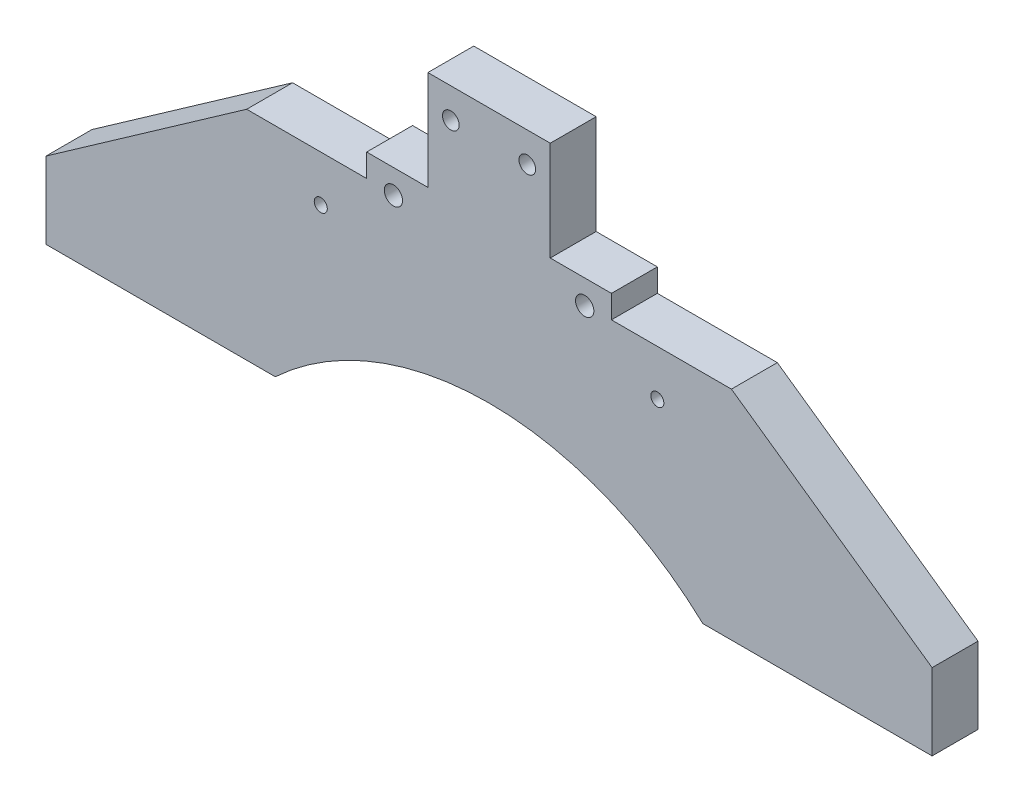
ISO-10303-21;
HEADER;
FILE_DESCRIPTION(('STEP AP214'),'2;1');
FILE_NAME('part.step','',(''),(''),'','','');
FILE_SCHEMA(('AUTOMOTIVE_DESIGN { 1 0 10303 214 1 1 1 1 }'));
ENDSEC;
DATA;
#1=APPLICATION_CONTEXT('core data for automotive mechanical design processes');
#2=APPLICATION_PROTOCOL_DEFINITION('international standard','automotive_design',2000,#1);
#3=PRODUCT_CONTEXT('',#1,'mechanical');
#4=PRODUCT('Part','Part','',(#3));
#5=PRODUCT_RELATED_PRODUCT_CATEGORY('part','',(#4));
#6=PRODUCT_DEFINITION_FORMATION('','',#4);
#7=PRODUCT_DEFINITION_CONTEXT('part definition',#1,'design');
#8=PRODUCT_DEFINITION('design','',#6,#7);
#9=PRODUCT_DEFINITION_SHAPE('','',#8);
#10=(LENGTH_UNIT() NAMED_UNIT(*) SI_UNIT(.MILLI.,.METRE.));
#11=(NAMED_UNIT(*) PLANE_ANGLE_UNIT() SI_UNIT($,.RADIAN.));
#12=(NAMED_UNIT(*) SI_UNIT($,.STERADIAN.) SOLID_ANGLE_UNIT());
#13=UNCERTAINTY_MEASURE_WITH_UNIT(LENGTH_MEASURE(1.E-05),#10,'distance_accuracy_value','');
#14=(GEOMETRIC_REPRESENTATION_CONTEXT(3) GLOBAL_UNCERTAINTY_ASSIGNED_CONTEXT((#13)) GLOBAL_UNIT_ASSIGNED_CONTEXT((#10,
#11,#12)) REPRESENTATION_CONTEXT('',''));
#15=CARTESIAN_POINT('',(0.,0.,0.));
#16=DIRECTION('',(0.,0.,1.));
#17=DIRECTION('',(1.,0.,0.));
#18=AXIS2_PLACEMENT_3D('',#15,#16,#17);
#19=CARTESIAN_POINT('',(0.,-47.625,9.525));
#20=DIRECTION('',(0.,0.,-1.));
#21=DIRECTION('',(-1.,0.,0.));
#22=AXIS2_PLACEMENT_3D('',#19,#20,#21);
#23=CYLINDRICAL_SURFACE('',#22,72.23125);
#24=CARTESIAN_POINT('',(0.,-47.625,3.175));
#25=DIRECTION('',(0.,0.,1.));
#26=DIRECTION('',(1.,0.,0.));
#27=AXIS2_PLACEMENT_3D('',#24,#25,#26);
#28=CIRCLE('',#27,72.23125);
#29=CARTESIAN_POINT('',(54.306655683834,0.,3.175));
#30=VERTEX_POINT('',#29);
#31=CARTESIAN_POINT('',(-54.306655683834,0.,3.175));
#32=VERTEX_POINT('',#31);
#33=EDGE_CURVE('E397',#30,#32,#28,.T.);
#34=ORIENTED_EDGE('',*,*,#33,.T.);
#35=DIRECTION('',(0.,0.,-1.));
#36=VECTOR('',#35,1.);
#37=CARTESIAN_POINT('',(-54.306655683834,0.,9.525));
#38=LINE('',#37,#36);
#39=CARTESIAN_POINT('',(-54.306655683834,0.,0.));
#40=VERTEX_POINT('',#39);
#41=EDGE_CURVE('E277',#32,#40,#38,.T.);
#42=ORIENTED_EDGE('',*,*,#41,.T.);
#43=CARTESIAN_POINT('',(0.,-47.625,0.));
#44=DIRECTION('',(0.,0.,-1.));
#45=DIRECTION('',(1.,0.,0.));
#46=AXIS2_PLACEMENT_3D('',#43,#44,#45);
#47=CIRCLE('',#46,72.23125);
#48=CARTESIAN_POINT('',(54.306655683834,0.,0.));
#49=VERTEX_POINT('',#48);
#50=EDGE_CURVE('E267',#40,#49,#47,.T.);
#51=ORIENTED_EDGE('',*,*,#50,.T.);
#52=DIRECTION('',(0.,0.,-1.));
#53=VECTOR('',#52,1.);
#54=CARTESIAN_POINT('',(54.306655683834,0.,9.525));
#55=LINE('',#54,#53);
#56=EDGE_CURVE('E131',#30,#49,#55,.T.);
#57=ORIENTED_EDGE('',*,*,#56,.F.);
#58=EDGE_LOOP('',(#34,#42,#51,#57));
#59=FACE_BOUND('',#58,.T.);
#60=ADVANCED_FACE('F44',(#59),#23,.F.);
#61=CARTESIAN_POINT('',(91.948,15.875,9.525));
#62=DIRECTION('',(-1.,0.,0.));
#63=DIRECTION('',(0.,-1.,0.));
#64=AXIS2_PLACEMENT_3D('',#61,#62,#63);
#65=PLANE('',#64);
#66=DIRECTION('',(0.,1.,0.));
#67=VECTOR('',#66,1.);
#68=CARTESIAN_POINT('',(91.948,15.875,0.));
#69=LINE('',#68,#67);
#70=CARTESIAN_POINT('',(91.948,0.,0.));
#71=VERTEX_POINT('',#70);
#72=CARTESIAN_POINT('',(91.948,15.875,0.));
#73=VERTEX_POINT('',#72);
#74=EDGE_CURVE('E224',#71,#73,#69,.T.);
#75=ORIENTED_EDGE('',*,*,#74,.T.);
#76=DIRECTION('',(0.,0.,-1.));
#77=VECTOR('',#76,1.);
#78=CARTESIAN_POINT('',(91.948,15.875,9.525));
#79=LINE('',#78,#77);
#80=CARTESIAN_POINT('',(91.948,15.875,9.525));
#81=VERTEX_POINT('',#80);
#82=EDGE_CURVE('E11',#81,#73,#79,.T.);
#83=ORIENTED_EDGE('',*,*,#82,.F.);
#84=DIRECTION('',(0.,1.,0.));
#85=VECTOR('',#84,1.);
#86=CARTESIAN_POINT('',(91.948,15.875,9.525));
#87=LINE('',#86,#85);
#88=CARTESIAN_POINT('',(91.948,0.,9.525));
#89=VERTEX_POINT('',#88);
#90=EDGE_CURVE('E272',#89,#81,#87,.T.);
#91=ORIENTED_EDGE('',*,*,#90,.F.);
#92=DIRECTION('',(0.,0.,-1.));
#93=VECTOR('',#92,1.);
#94=CARTESIAN_POINT('',(91.948,0.,9.525));
#95=LINE('',#94,#93);
#96=EDGE_CURVE('E223',#89,#71,#95,.T.);
#97=ORIENTED_EDGE('',*,*,#96,.T.);
#98=EDGE_LOOP('',(#75,#83,#91,#97));
#99=FACE_BOUND('',#98,.T.);
#100=ADVANCED_FACE('F46',(#99),#65,.F.);
#101=CARTESIAN_POINT('',(91.948,15.875,9.525));
#102=DIRECTION('',(-0.574545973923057,-0.818472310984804,0.));
#103=DIRECTION('',(0.818472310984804,-0.574545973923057,0.));
#104=AXIS2_PLACEMENT_3D('',#101,#102,#103);
#105=PLANE('',#104);
#106=DIRECTION('',(-0.818472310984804,0.574545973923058,0.));
#107=VECTOR('',#106,1.);
#108=CARTESIAN_POINT('',(91.948,15.875,0.));
#109=LINE('',#108,#107);
#110=CARTESIAN_POINT('',(50.3005662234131,45.1104,0.));
#111=VERTEX_POINT('',#110);
#112=EDGE_CURVE('E228',#73,#111,#109,.T.);
#113=ORIENTED_EDGE('',*,*,#112,.T.);
#114=DIRECTION('',(0.,0.,-1.));
#115=VECTOR('',#114,1.);
#116=CARTESIAN_POINT('',(50.3005662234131,45.1104,9.525));
#117=LINE('',#116,#115);
#118=CARTESIAN_POINT('',(50.3005662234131,45.1104,9.525));
#119=VERTEX_POINT('',#118);
#120=EDGE_CURVE('E54',#119,#111,#117,.T.);
#121=ORIENTED_EDGE('',*,*,#120,.F.);
#122=DIRECTION('',(-0.818472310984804,0.574545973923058,0.));
#123=VECTOR('',#122,1.);
#124=CARTESIAN_POINT('',(91.948,15.875,9.525));
#125=LINE('',#124,#123);
#126=EDGE_CURVE('E144',#81,#119,#125,.T.);
#127=ORIENTED_EDGE('',*,*,#126,.F.);
#128=ORIENTED_EDGE('',*,*,#82,.T.);
#129=EDGE_LOOP('',(#113,#121,#127,#128));
#130=FACE_BOUND('',#129,.T.);
#131=ADVANCED_FACE('F428',(#130),#105,.F.);
#132=CARTESIAN_POINT('',(25.4,45.1104,9.525));
#133=DIRECTION('',(0.,-1.,0.));
#134=DIRECTION('',(1.,0.,0.));
#135=AXIS2_PLACEMENT_3D('',#132,#133,#134);
#136=PLANE('',#135);
#137=DIRECTION('',(-1.,0.,0.));
#138=VECTOR('',#137,1.);
#139=CARTESIAN_POINT('',(25.4,45.1104,0.));
#140=LINE('',#139,#138);
#141=CARTESIAN_POINT('',(25.4,45.1104,0.));
#142=VERTEX_POINT('',#141);
#143=EDGE_CURVE('E232',#111,#142,#140,.T.);
#144=ORIENTED_EDGE('',*,*,#143,.T.);
#145=DIRECTION('',(0.,0.,-1.));
#146=VECTOR('',#145,1.);
#147=CARTESIAN_POINT('',(25.4,45.1104,9.525));
#148=LINE('',#147,#146);
#149=CARTESIAN_POINT('',(25.4,45.1104,9.525));
#150=VERTEX_POINT('',#149);
#151=EDGE_CURVE('E309',#150,#142,#148,.T.);
#152=ORIENTED_EDGE('',*,*,#151,.F.);
#153=DIRECTION('',(-1.,0.,0.));
#154=VECTOR('',#153,1.);
#155=CARTESIAN_POINT('',(25.4,45.1104,9.525));
#156=LINE('',#155,#154);
#157=EDGE_CURVE('E320',#119,#150,#156,.T.);
#158=ORIENTED_EDGE('',*,*,#157,.F.);
#159=ORIENTED_EDGE('',*,*,#120,.T.);
#160=EDGE_LOOP('',(#144,#152,#158,#159));
#161=FACE_BOUND('',#160,.T.);
#162=ADVANCED_FACE('F318',(#161),#136,.F.);
#163=CARTESIAN_POINT('',(25.4,49.8729,9.525));
#164=DIRECTION('',(-1.,0.,0.));
#165=DIRECTION('',(0.,0.,1.));
#166=AXIS2_PLACEMENT_3D('',#163,#164,#165);
#167=PLANE('',#166);
#168=DIRECTION('',(0.,1.,0.));
#169=VECTOR('',#168,1.);
#170=CARTESIAN_POINT('',(25.4,49.8729,0.));
#171=LINE('',#170,#169);
#172=CARTESIAN_POINT('',(25.4,49.8729,0.));
#173=VERTEX_POINT('',#172);
#174=EDGE_CURVE('E235',#142,#173,#171,.T.);
#175=ORIENTED_EDGE('',*,*,#174,.T.);
#176=DIRECTION('',(0.,0.,-1.));
#177=VECTOR('',#176,1.);
#178=CARTESIAN_POINT('',(25.4,49.8729,9.525));
#179=LINE('',#178,#177);
#180=CARTESIAN_POINT('',(25.4,49.8729,9.525));
#181=VERTEX_POINT('',#180);
#182=EDGE_CURVE('E305',#181,#173,#179,.T.);
#183=ORIENTED_EDGE('',*,*,#182,.F.);
#184=DIRECTION('',(0.,1.,0.));
#185=VECTOR('',#184,1.);
#186=CARTESIAN_POINT('',(25.4,49.8729,9.525));
#187=LINE('',#186,#185);
#188=EDGE_CURVE('E339',#150,#181,#187,.T.);
#189=ORIENTED_EDGE('',*,*,#188,.F.);
#190=ORIENTED_EDGE('',*,*,#151,.T.);
#191=EDGE_LOOP('',(#175,#183,#189,#190));
#192=FACE_BOUND('',#191,.T.);
#193=ADVANCED_FACE('F329',(#192),#167,.F.);
#194=CARTESIAN_POINT('',(12.7,49.8729,9.525));
#195=DIRECTION('',(0.,-1.,0.));
#196=DIRECTION('',(0.,0.,-1.));
#197=AXIS2_PLACEMENT_3D('',#194,#195,#196);
#198=PLANE('',#197);
#199=DIRECTION('',(-1.,0.,0.));
#200=VECTOR('',#199,1.);
#201=CARTESIAN_POINT('',(12.7,49.8729,0.));
#202=LINE('',#201,#200);
#203=CARTESIAN_POINT('',(12.7,49.8729,0.));
#204=VERTEX_POINT('',#203);
#205=EDGE_CURVE('E238',#173,#204,#202,.T.);
#206=ORIENTED_EDGE('',*,*,#205,.T.);
#207=DIRECTION('',(0.,0.,-1.));
#208=VECTOR('',#207,1.);
#209=CARTESIAN_POINT('',(12.7,49.8729,9.525));
#210=LINE('',#209,#208);
#211=CARTESIAN_POINT('',(12.7,49.8729,9.525));
#212=VERTEX_POINT('',#211);
#213=EDGE_CURVE('E301',#212,#204,#210,.T.);
#214=ORIENTED_EDGE('',*,*,#213,.F.);
#215=DIRECTION('',(-1.,0.,0.));
#216=VECTOR('',#215,1.);
#217=CARTESIAN_POINT('',(12.7,49.8729,9.525));
#218=LINE('',#217,#216);
#219=EDGE_CURVE('E335',#181,#212,#218,.T.);
#220=ORIENTED_EDGE('',*,*,#219,.F.);
#221=ORIENTED_EDGE('',*,*,#182,.T.);
#222=EDGE_LOOP('',(#206,#214,#220,#221));
#223=FACE_BOUND('',#222,.T.);
#224=ADVANCED_FACE('F333',(#223),#198,.F.);
#225=CARTESIAN_POINT('',(12.7,70.5104,9.525));
#226=DIRECTION('',(-1.,0.,0.));
#227=DIRECTION('',(0.,-1.,0.));
#228=AXIS2_PLACEMENT_3D('',#225,#226,#227);
#229=PLANE('',#228);
#230=DIRECTION('',(0.,1.,0.));
#231=VECTOR('',#230,1.);
#232=CARTESIAN_POINT('',(12.7,70.5104,0.));
#233=LINE('',#232,#231);
#234=CARTESIAN_POINT('',(12.7,70.5104,0.));
#235=VERTEX_POINT('',#234);
#236=EDGE_CURVE('E241',#204,#235,#233,.T.);
#237=ORIENTED_EDGE('',*,*,#236,.T.);
#238=DIRECTION('',(0.,0.,-1.));
#239=VECTOR('',#238,1.);
#240=CARTESIAN_POINT('',(12.7,70.5104,9.525));
#241=LINE('',#240,#239);
#242=CARTESIAN_POINT('',(12.7,70.5104,9.525));
#243=VERTEX_POINT('',#242);
#244=EDGE_CURVE('E297',#243,#235,#241,.T.);
#245=ORIENTED_EDGE('',*,*,#244,.F.);
#246=DIRECTION('',(0.,1.,0.));
#247=VECTOR('',#246,1.);
#248=CARTESIAN_POINT('',(12.7,70.5104,9.525));
#249=LINE('',#248,#247);
#250=EDGE_CURVE('E338',#212,#243,#249,.T.);
#251=ORIENTED_EDGE('',*,*,#250,.F.);
#252=ORIENTED_EDGE('',*,*,#213,.T.);
#253=EDGE_LOOP('',(#237,#245,#251,#252));
#254=FACE_BOUND('',#253,.T.);
#255=ADVANCED_FACE('F464',(#254),#229,.F.);
#256=CARTESIAN_POINT('',(-12.7,70.5104,9.525));
#257=DIRECTION('',(0.,-1.,0.));
#258=DIRECTION('',(0.,0.,-1.));
#259=AXIS2_PLACEMENT_3D('',#256,#257,#258);
#260=PLANE('',#259);
#261=DIRECTION('',(-1.,0.,0.));
#262=VECTOR('',#261,1.);
#263=CARTESIAN_POINT('',(-12.7,70.5104,0.));
#264=LINE('',#263,#262);
#265=CARTESIAN_POINT('',(-12.7,70.5104,0.));
#266=VERTEX_POINT('',#265);
#267=EDGE_CURVE('E244',#235,#266,#264,.T.);
#268=ORIENTED_EDGE('',*,*,#267,.T.);
#269=DIRECTION('',(0.,0.,-1.));
#270=VECTOR('',#269,1.);
#271=CARTESIAN_POINT('',(-12.7,70.5104,9.525));
#272=LINE('',#271,#270);
#273=CARTESIAN_POINT('',(-12.7,70.5104,9.525));
#274=VERTEX_POINT('',#273);
#275=EDGE_CURVE('E293',#274,#266,#272,.T.);
#276=ORIENTED_EDGE('',*,*,#275,.F.);
#277=DIRECTION('',(-1.,0.,0.));
#278=VECTOR('',#277,1.);
#279=CARTESIAN_POINT('',(-12.7,70.5104,9.525));
#280=LINE('',#279,#278);
#281=EDGE_CURVE('E343',#243,#274,#280,.T.);
#282=ORIENTED_EDGE('',*,*,#281,.F.);
#283=ORIENTED_EDGE('',*,*,#244,.T.);
#284=EDGE_LOOP('',(#268,#276,#282,#283));
#285=FACE_BOUND('',#284,.T.);
#286=ADVANCED_FACE('F460',(#285),#260,.F.);
#287=CARTESIAN_POINT('',(-12.7,49.8729,9.525));
#288=DIRECTION('',(1.,0.,0.));
#289=DIRECTION('',(0.,1.,0.));
#290=AXIS2_PLACEMENT_3D('',#287,#288,#289);
#291=PLANE('',#290);
#292=DIRECTION('',(0.,-1.,0.));
#293=VECTOR('',#292,1.);
#294=CARTESIAN_POINT('',(-12.7,49.8729,0.));
#295=LINE('',#294,#293);
#296=CARTESIAN_POINT('',(-12.7,49.8729,0.));
#297=VERTEX_POINT('',#296);
#298=EDGE_CURVE('E247',#266,#297,#295,.T.);
#299=ORIENTED_EDGE('',*,*,#298,.T.);
#300=DIRECTION('',(0.,0.,-1.));
#301=VECTOR('',#300,1.);
#302=CARTESIAN_POINT('',(-12.7,49.8729,9.525));
#303=LINE('',#302,#301);
#304=CARTESIAN_POINT('',(-12.7,49.8729,9.525));
#305=VERTEX_POINT('',#304);
#306=EDGE_CURVE('E289',#305,#297,#303,.T.);
#307=ORIENTED_EDGE('',*,*,#306,.F.);
#308=DIRECTION('',(0.,-1.,0.));
#309=VECTOR('',#308,1.);
#310=CARTESIAN_POINT('',(-12.7,49.8729,9.525));
#311=LINE('',#310,#309);
#312=EDGE_CURVE('E350',#274,#305,#311,.T.);
#313=ORIENTED_EDGE('',*,*,#312,.F.);
#314=ORIENTED_EDGE('',*,*,#275,.T.);
#315=EDGE_LOOP('',(#299,#307,#313,#314));
#316=FACE_BOUND('',#315,.T.);
#317=ADVANCED_FACE('F456',(#316),#291,.F.);
#318=CARTESIAN_POINT('',(-25.4,49.8729,9.525));
#319=DIRECTION('',(0.,-1.,0.));
#320=DIRECTION('',(0.,0.,-1.));
#321=AXIS2_PLACEMENT_3D('',#318,#319,#320);
#322=PLANE('',#321);
#323=DIRECTION('',(-1.,0.,0.));
#324=VECTOR('',#323,1.);
#325=CARTESIAN_POINT('',(-25.4,49.8729,0.));
#326=LINE('',#325,#324);
#327=CARTESIAN_POINT('',(-25.4,49.8729,0.));
#328=VERTEX_POINT('',#327);
#329=EDGE_CURVE('E250',#297,#328,#326,.T.);
#330=ORIENTED_EDGE('',*,*,#329,.T.);
#331=DIRECTION('',(0.,0.,-1.));
#332=VECTOR('',#331,1.);
#333=CARTESIAN_POINT('',(-25.4,49.8729,9.525));
#334=LINE('',#333,#332);
#335=CARTESIAN_POINT('',(-25.4,49.8729,9.525));
#336=VERTEX_POINT('',#335);
#337=EDGE_CURVE('E286',#336,#328,#334,.T.);
#338=ORIENTED_EDGE('',*,*,#337,.F.);
#339=DIRECTION('',(-1.,0.,0.));
#340=VECTOR('',#339,1.);
#341=CARTESIAN_POINT('',(-25.4,49.8729,9.525));
#342=LINE('',#341,#340);
#343=EDGE_CURVE('E352',#305,#336,#342,.T.);
#344=ORIENTED_EDGE('',*,*,#343,.F.);
#345=ORIENTED_EDGE('',*,*,#306,.T.);
#346=EDGE_LOOP('',(#330,#338,#344,#345));
#347=FACE_BOUND('',#346,.T.);
#348=ADVANCED_FACE('F453',(#347),#322,.F.);
#349=CARTESIAN_POINT('',(-25.4,45.1104,9.525));
#350=DIRECTION('',(1.,0.,0.));
#351=DIRECTION('',(0.,0.,-1.));
#352=AXIS2_PLACEMENT_3D('',#349,#350,#351);
#353=PLANE('',#352);
#354=DIRECTION('',(0.,-1.,0.));
#355=VECTOR('',#354,1.);
#356=CARTESIAN_POINT('',(-25.4,45.1104,0.));
#357=LINE('',#356,#355);
#358=CARTESIAN_POINT('',(-25.4,45.1104,0.));
#359=VERTEX_POINT('',#358);
#360=EDGE_CURVE('E253',#328,#359,#357,.T.);
#361=ORIENTED_EDGE('',*,*,#360,.T.);
#362=DIRECTION('',(0.,0.,-1.));
#363=VECTOR('',#362,1.);
#364=CARTESIAN_POINT('',(-25.4,45.1104,9.525));
#365=LINE('',#364,#363);
#366=CARTESIAN_POINT('',(-25.4,45.1104,9.525));
#367=VERTEX_POINT('',#366);
#368=EDGE_CURVE('E283',#367,#359,#365,.T.);
#369=ORIENTED_EDGE('',*,*,#368,.F.);
#370=DIRECTION('',(0.,-1.,0.));
#371=VECTOR('',#370,1.);
#372=CARTESIAN_POINT('',(-25.4,45.1104,9.525));
#373=LINE('',#372,#371);
#374=EDGE_CURVE('E354',#336,#367,#373,.T.);
#375=ORIENTED_EDGE('',*,*,#374,.F.);
#376=ORIENTED_EDGE('',*,*,#337,.T.);
#377=EDGE_LOOP('',(#361,#369,#375,#376));
#378=FACE_BOUND('',#377,.T.);
#379=ADVANCED_FACE('F360',(#378),#353,.F.);
#380=CARTESIAN_POINT('',(-50.3005662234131,45.1104,9.525));
#381=DIRECTION('',(0.,-1.,0.));
#382=DIRECTION('',(0.,0.,-1.));
#383=AXIS2_PLACEMENT_3D('',#380,#381,#382);
#384=PLANE('',#383);
#385=DIRECTION('',(-1.,0.,0.));
#386=VECTOR('',#385,1.);
#387=CARTESIAN_POINT('',(-50.3005662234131,45.1104,0.));
#388=LINE('',#387,#386);
#389=CARTESIAN_POINT('',(-50.3005662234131,45.1104,0.));
#390=VERTEX_POINT('',#389);
#391=EDGE_CURVE('E255',#359,#390,#388,.T.);
#392=ORIENTED_EDGE('',*,*,#391,.T.);
#393=DIRECTION('',(0.,0.,-1.));
#394=VECTOR('',#393,1.);
#395=CARTESIAN_POINT('',(-50.3005662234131,45.1104,9.525));
#396=LINE('',#395,#394);
#397=CARTESIAN_POINT('',(-50.3005662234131,45.1104,9.525));
#398=VERTEX_POINT('',#397);
#399=EDGE_CURVE('E207',#398,#390,#396,.T.);
#400=ORIENTED_EDGE('',*,*,#399,.F.);
#401=DIRECTION('',(-1.,0.,0.));
#402=VECTOR('',#401,1.);
#403=CARTESIAN_POINT('',(-50.3005662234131,45.1104,9.525));
#404=LINE('',#403,#402);
#405=EDGE_CURVE('E193',#367,#398,#404,.T.);
#406=ORIENTED_EDGE('',*,*,#405,.F.);
#407=ORIENTED_EDGE('',*,*,#368,.T.);
#408=EDGE_LOOP('',(#392,#400,#406,#407));
#409=FACE_BOUND('',#408,.T.);
#410=ADVANCED_FACE('F364',(#409),#384,.F.);
#411=CARTESIAN_POINT('',(-91.948,15.875,9.525));
#412=DIRECTION('',(0.574545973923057,-0.818472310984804,0.));
#413=DIRECTION('',(0.818472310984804,0.574545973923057,0.));
#414=AXIS2_PLACEMENT_3D('',#411,#412,#413);
#415=PLANE('',#414);
#416=DIRECTION('',(-0.818472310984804,-0.574545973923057,0.));
#417=VECTOR('',#416,1.);
#418=CARTESIAN_POINT('',(-91.948,15.875,0.));
#419=LINE('',#418,#417);
#420=CARTESIAN_POINT('',(-91.948,15.875,0.));
#421=VERTEX_POINT('',#420);
#422=EDGE_CURVE('E203',#390,#421,#419,.T.);
#423=ORIENTED_EDGE('',*,*,#422,.T.);
#424=DIRECTION('',(0.,0.,-1.));
#425=VECTOR('',#424,1.);
#426=CARTESIAN_POINT('',(-91.948,15.875,9.525));
#427=LINE('',#426,#425);
#428=CARTESIAN_POINT('',(-91.948,15.875,9.525));
#429=VERTEX_POINT('',#428);
#430=EDGE_CURVE('E200',#429,#421,#427,.T.);
#431=ORIENTED_EDGE('',*,*,#430,.F.);
#432=DIRECTION('',(-0.818472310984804,-0.574545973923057,0.));
#433=VECTOR('',#432,1.);
#434=CARTESIAN_POINT('',(-91.948,15.875,9.525));
#435=LINE('',#434,#433);
#436=EDGE_CURVE('E185',#398,#429,#435,.T.);
#437=ORIENTED_EDGE('',*,*,#436,.F.);
#438=ORIENTED_EDGE('',*,*,#399,.T.);
#439=EDGE_LOOP('',(#423,#431,#437,#438));
#440=FACE_BOUND('',#439,.T.);
#441=ADVANCED_FACE('F201',(#440),#415,.F.);
#442=CARTESIAN_POINT('',(-91.948,15.875,9.525));
#443=DIRECTION('',(1.,0.,0.));
#444=DIRECTION('',(0.,1.,0.));
#445=AXIS2_PLACEMENT_3D('',#442,#443,#444);
#446=PLANE('',#445);
#447=DIRECTION('',(0.,-1.,0.));
#448=VECTOR('',#447,1.);
#449=CARTESIAN_POINT('',(-91.948,15.875,0.));
#450=LINE('',#449,#448);
#451=CARTESIAN_POINT('',(-91.948,0.,0.));
#452=VERTEX_POINT('',#451);
#453=EDGE_CURVE('E260',#421,#452,#450,.T.);
#454=ORIENTED_EDGE('',*,*,#453,.T.);
#455=DIRECTION('',(0.,0.,-1.));
#456=VECTOR('',#455,1.);
#457=CARTESIAN_POINT('',(-91.948,0.,9.525));
#458=LINE('',#457,#456);
#459=CARTESIAN_POINT('',(-91.948,0.,9.525));
#460=VERTEX_POINT('',#459);
#461=EDGE_CURVE('E208',#460,#452,#458,.T.);
#462=ORIENTED_EDGE('',*,*,#461,.F.);
#463=DIRECTION('',(0.,-1.,0.));
#464=VECTOR('',#463,1.);
#465=CARTESIAN_POINT('',(-91.948,15.875,9.525));
#466=LINE('',#465,#464);
#467=EDGE_CURVE('E190',#429,#460,#466,.T.);
#468=ORIENTED_EDGE('',*,*,#467,.F.);
#469=ORIENTED_EDGE('',*,*,#430,.T.);
#470=EDGE_LOOP('',(#454,#462,#468,#469));
#471=FACE_BOUND('',#470,.T.);
#472=ADVANCED_FACE('F210',(#471),#446,.F.);
#473=CARTESIAN_POINT('',(-91.948,0.,9.525));
#474=DIRECTION('',(0.,1.,0.));
#475=DIRECTION('',(0.,0.,1.));
#476=AXIS2_PLACEMENT_3D('',#473,#474,#475);
#477=PLANE('',#476);
#478=DIRECTION('',(1.,0.,0.));
#479=VECTOR('',#478,1.);
#480=CARTESIAN_POINT('',(-91.948,0.,0.));
#481=LINE('',#480,#479);
#482=EDGE_CURVE('E263',#452,#40,#481,.T.);
#483=ORIENTED_EDGE('',*,*,#482,.T.);
#484=ORIENTED_EDGE('',*,*,#41,.F.);
#485=DIRECTION('',(1.,0.,0.));
#486=VECTOR('',#485,1.);
#487=CARTESIAN_POINT('',(-54.306655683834,0.,3.175));
#488=LINE('',#487,#486);
#489=CARTESIAN_POINT('',(-44.3648738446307,0.,3.175));
#490=VERTEX_POINT('',#489);
#491=EDGE_CURVE('E393',#32,#490,#488,.T.);
#492=ORIENTED_EDGE('',*,*,#491,.T.);
#493=DIRECTION('',(0.,0.,1.));
#494=VECTOR('',#493,1.);
#495=CARTESIAN_POINT('',(-44.3648738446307,0.,3.175));
#496=LINE('',#495,#494);
#497=CARTESIAN_POINT('',(-44.3648738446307,0.,9.525));
#498=VERTEX_POINT('',#497);
#499=EDGE_CURVE('E374',#490,#498,#496,.T.);
#500=ORIENTED_EDGE('',*,*,#499,.T.);
#501=DIRECTION('',(1.,0.,0.));
#502=VECTOR('',#501,1.);
#503=CARTESIAN_POINT('',(-91.948,0.,9.525));
#504=LINE('',#503,#502);
#505=EDGE_CURVE('E214',#460,#498,#504,.T.);
#506=ORIENTED_EDGE('',*,*,#505,.F.);
#507=ORIENTED_EDGE('',*,*,#461,.T.);
#508=EDGE_LOOP('',(#483,#484,#492,#500,#506,#507));
#509=FACE_BOUND('',#508,.T.);
#510=ADVANCED_FACE('F368',(#509),#477,.F.);
#511=CARTESIAN_POINT('',(54.306655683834,0.,9.525));
#512=DIRECTION('',(0.,1.,0.));
#513=DIRECTION('',(0.,0.,1.));
#514=AXIS2_PLACEMENT_3D('',#511,#512,#513);
#515=PLANE('',#514);
#516=DIRECTION('',(1.,0.,0.));
#517=VECTOR('',#516,1.);
#518=CARTESIAN_POINT('',(54.306655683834,0.,0.));
#519=LINE('',#518,#517);
#520=EDGE_CURVE('E136',#49,#71,#519,.T.);
#521=ORIENTED_EDGE('',*,*,#520,.T.);
#522=ORIENTED_EDGE('',*,*,#96,.F.);
#523=DIRECTION('',(1.,0.,0.));
#524=VECTOR('',#523,1.);
#525=CARTESIAN_POINT('',(54.306655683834,0.,9.525));
#526=LINE('',#525,#524);
#527=CARTESIAN_POINT('',(44.3648738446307,0.,9.525));
#528=VERTEX_POINT('',#527);
#529=EDGE_CURVE('E65',#528,#89,#526,.T.);
#530=ORIENTED_EDGE('',*,*,#529,.F.);
#531=DIRECTION('',(0.,0.,1.));
#532=VECTOR('',#531,1.);
#533=CARTESIAN_POINT('',(44.3648738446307,0.,3.175));
#534=LINE('',#533,#532);
#535=CARTESIAN_POINT('',(44.3648738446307,0.,3.175));
#536=VERTEX_POINT('',#535);
#537=EDGE_CURVE('E229',#536,#528,#534,.T.);
#538=ORIENTED_EDGE('',*,*,#537,.F.);
#539=DIRECTION('',(1.,0.,0.));
#540=VECTOR('',#539,1.);
#541=CARTESIAN_POINT('',(54.306655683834,0.,3.175));
#542=LINE('',#541,#540);
#543=EDGE_CURVE('E413',#536,#30,#542,.T.);
#544=ORIENTED_EDGE('',*,*,#543,.T.);
#545=ORIENTED_EDGE('',*,*,#56,.T.);
#546=EDGE_LOOP('',(#521,#522,#530,#538,#544,#545));
#547=FACE_BOUND('',#546,.T.);
#548=ADVANCED_FACE('F441',(#547),#515,.F.);
#549=CARTESIAN_POINT('',(0.,-47.625,9.525));
#550=DIRECTION('',(0.,0.,1.));
#551=DIRECTION('',(1.,0.,0.));
#552=AXIS2_PLACEMENT_3D('',#549,#550,#551);
#553=PLANE('',#552);
#554=CARTESIAN_POINT('',(34.925,35.5854,9.525));
#555=DIRECTION('',(0.,0.,1.));
#556=DIRECTION('',(1.,0.,0.));
#557=AXIS2_PLACEMENT_3D('',#554,#555,#556);
#558=CIRCLE('',#557,1.35255);
#559=CARTESIAN_POINT('',(36.27755,35.5854,9.525));
#560=VERTEX_POINT('',#559);
#561=EDGE_CURVE('E727',#560,#560,#558,.T.);
#562=ORIENTED_EDGE('',*,*,#561,.F.);
#563=EDGE_LOOP('',(#562));
#564=FACE_BOUND('',#563,.T.);
#565=CARTESIAN_POINT('',(-34.925,35.5854,9.525));
#566=DIRECTION('',(0.,0.,1.));
#567=DIRECTION('',(1.,0.,0.));
#568=AXIS2_PLACEMENT_3D('',#565,#566,#567);
#569=CIRCLE('',#568,1.35255);
#570=CARTESIAN_POINT('',(-33.57245,35.5854,9.525));
#571=VERTEX_POINT('',#570);
#572=EDGE_CURVE('E739',#571,#571,#569,.T.);
#573=ORIENTED_EDGE('',*,*,#572,.F.);
#574=EDGE_LOOP('',(#573));
#575=FACE_BOUND('',#574,.T.);
#576=CARTESIAN_POINT('',(19.8501,44.8564,9.525));
#577=DIRECTION('',(0.,0.,-1.));
#578=DIRECTION('',(-1.,0.,0.));
#579=AXIS2_PLACEMENT_3D('',#576,#577,#578);
#580=CIRCLE('',#579,1.89865);
#581=CARTESIAN_POINT('',(17.95145,44.8564,9.525));
#582=VERTEX_POINT('',#581);
#583=EDGE_CURVE('E754',#582,#582,#580,.T.);
#584=ORIENTED_EDGE('',*,*,#583,.T.);
#585=EDGE_LOOP('',(#584));
#586=FACE_BOUND('',#585,.T.);
#587=CARTESIAN_POINT('',(-19.8501,44.8564,9.525));
#588=DIRECTION('',(0.,0.,-1.));
#589=DIRECTION('',(-1.,0.,0.));
#590=AXIS2_PLACEMENT_3D('',#587,#588,#589);
#591=CIRCLE('',#590,1.89865);
#592=CARTESIAN_POINT('',(-21.74875,44.8564,9.525));
#593=VERTEX_POINT('',#592);
#594=EDGE_CURVE('E768',#593,#593,#591,.T.);
#595=ORIENTED_EDGE('',*,*,#594,.T.);
#596=EDGE_LOOP('',(#595));
#597=FACE_BOUND('',#596,.T.);
#598=CARTESIAN_POINT('',(-7.93750000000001,64.2874,9.525));
#599=DIRECTION('',(0.,0.,1.));
#600=DIRECTION('',(1.,0.,0.));
#601=AXIS2_PLACEMENT_3D('',#598,#599,#600);
#602=CIRCLE('',#601,1.7272);
#603=CARTESIAN_POINT('',(-6.21030000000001,64.2874,9.525));
#604=VERTEX_POINT('',#603);
#605=EDGE_CURVE('E771',#604,#604,#602,.T.);
#606=ORIENTED_EDGE('',*,*,#605,.F.);
#607=EDGE_LOOP('',(#606));
#608=FACE_BOUND('',#607,.T.);
#609=CARTESIAN_POINT('',(7.93749999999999,64.2874,9.525));
#610=DIRECTION('',(0.,0.,1.));
#611=DIRECTION('',(1.,0.,0.));
#612=AXIS2_PLACEMENT_3D('',#609,#610,#611);
#613=CIRCLE('',#612,1.7272);
#614=CARTESIAN_POINT('',(9.66469999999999,64.2874,9.525));
#615=VERTEX_POINT('',#614);
#616=EDGE_CURVE('E777',#615,#615,#613,.T.);
#617=ORIENTED_EDGE('',*,*,#616,.F.);
#618=EDGE_LOOP('',(#617));
#619=FACE_BOUND('',#618,.T.);
#620=ORIENTED_EDGE('',*,*,#90,.T.);
#621=ORIENTED_EDGE('',*,*,#126,.T.);
#622=ORIENTED_EDGE('',*,*,#157,.T.);
#623=ORIENTED_EDGE('',*,*,#188,.T.);
#624=ORIENTED_EDGE('',*,*,#219,.T.);
#625=ORIENTED_EDGE('',*,*,#250,.T.);
#626=ORIENTED_EDGE('',*,*,#281,.T.);
#627=ORIENTED_EDGE('',*,*,#312,.T.);
#628=ORIENTED_EDGE('',*,*,#343,.T.);
#629=ORIENTED_EDGE('',*,*,#374,.T.);
#630=ORIENTED_EDGE('',*,*,#405,.T.);
#631=ORIENTED_EDGE('',*,*,#436,.T.);
#632=ORIENTED_EDGE('',*,*,#467,.T.);
#633=ORIENTED_EDGE('',*,*,#505,.T.);
#634=CARTESIAN_POINT('',(0.,-47.625,9.525));
#635=DIRECTION('',(0.,0.,-1.));
#636=DIRECTION('',(1.,0.,0.));
#637=AXIS2_PLACEMENT_3D('',#634,#635,#636);
#638=CIRCLE('',#637,65.0875);
#639=EDGE_CURVE('E376',#498,#528,#638,.T.);
#640=ORIENTED_EDGE('',*,*,#639,.T.);
#641=ORIENTED_EDGE('',*,*,#529,.T.);
#642=EDGE_LOOP('',(#620,#621,#622,#623,#624,#625,#626,#627,#628,#629,#630,#631,#632,#633,#640,#641));
#643=FACE_BOUND('',#642,.T.);
#644=ADVANCED_FACE('F187',(#564,#575,#586,#597,#608,#619,#643),#553,.T.);
#645=CARTESIAN_POINT('',(0.,-47.625,0.));
#646=DIRECTION('',(0.,0.,1.));
#647=DIRECTION('',(1.,0.,0.));
#648=AXIS2_PLACEMENT_3D('',#645,#646,#647);
#649=PLANE('',#648);
#650=CARTESIAN_POINT('',(34.925,35.5854,0.));
#651=DIRECTION('',(0.,0.,-1.));
#652=DIRECTION('',(-1.,0.,0.));
#653=AXIS2_PLACEMENT_3D('',#650,#651,#652);
#654=CIRCLE('',#653,1.35255);
#655=CARTESIAN_POINT('',(33.57245,35.5854,0.));
#656=VERTEX_POINT('',#655);
#657=EDGE_CURVE('E730',#656,#656,#654,.T.);
#658=ORIENTED_EDGE('',*,*,#657,.F.);
#659=EDGE_LOOP('',(#658));
#660=FACE_BOUND('',#659,.T.);
#661=CARTESIAN_POINT('',(-34.925,35.5854,0.));
#662=DIRECTION('',(0.,0.,-1.));
#663=DIRECTION('',(-1.,0.,0.));
#664=AXIS2_PLACEMENT_3D('',#661,#662,#663);
#665=CIRCLE('',#664,1.35255);
#666=CARTESIAN_POINT('',(-36.27755,35.5854,0.));
#667=VERTEX_POINT('',#666);
#668=EDGE_CURVE('E733',#667,#667,#665,.T.);
#669=ORIENTED_EDGE('',*,*,#668,.F.);
#670=EDGE_LOOP('',(#669));
#671=FACE_BOUND('',#670,.T.);
#672=CARTESIAN_POINT('',(19.8501,44.8564,0.));
#673=DIRECTION('',(0.,0.,-1.));
#674=DIRECTION('',(-1.,0.,0.));
#675=AXIS2_PLACEMENT_3D('',#672,#673,#674);
#676=CIRCLE('',#675,3.57250999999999);
#677=CARTESIAN_POINT('',(16.27759,44.8564,0.));
#678=VERTEX_POINT('',#677);
#679=EDGE_CURVE('E742',#678,#678,#676,.T.);
#680=ORIENTED_EDGE('',*,*,#679,.F.);
#681=EDGE_LOOP('',(#680));
#682=FACE_BOUND('',#681,.T.);
#683=CARTESIAN_POINT('',(-19.8501,44.8564,0.));
#684=DIRECTION('',(0.,0.,-1.));
#685=DIRECTION('',(-1.,0.,0.));
#686=AXIS2_PLACEMENT_3D('',#683,#684,#685);
#687=CIRCLE('',#686,3.57250999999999);
#688=CARTESIAN_POINT('',(-23.42261,44.8564,0.));
#689=VERTEX_POINT('',#688);
#690=EDGE_CURVE('E758',#689,#689,#687,.T.);
#691=ORIENTED_EDGE('',*,*,#690,.F.);
#692=EDGE_LOOP('',(#691));
#693=FACE_BOUND('',#692,.T.);
#694=CARTESIAN_POINT('',(-7.93750000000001,64.2874,0.));
#695=DIRECTION('',(0.,0.,1.));
#696=DIRECTION('',(1.,0.,0.));
#697=AXIS2_PLACEMENT_3D('',#694,#695,#696);
#698=CIRCLE('',#697,1.7272);
#699=CARTESIAN_POINT('',(-6.21030000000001,64.2874,0.));
#700=VERTEX_POINT('',#699);
#701=EDGE_CURVE('E774',#700,#700,#698,.T.);
#702=ORIENTED_EDGE('',*,*,#701,.T.);
#703=EDGE_LOOP('',(#702));
#704=FACE_BOUND('',#703,.T.);
#705=CARTESIAN_POINT('',(7.93749999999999,64.2874,0.));
#706=DIRECTION('',(0.,0.,1.));
#707=DIRECTION('',(1.,0.,0.));
#708=AXIS2_PLACEMENT_3D('',#705,#706,#707);
#709=CIRCLE('',#708,1.7272);
#710=CARTESIAN_POINT('',(9.66469999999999,64.2874,0.));
#711=VERTEX_POINT('',#710);
#712=EDGE_CURVE('E407',#711,#711,#709,.T.);
#713=ORIENTED_EDGE('',*,*,#712,.T.);
#714=EDGE_LOOP('',(#713));
#715=FACE_BOUND('',#714,.T.);
#716=ORIENTED_EDGE('',*,*,#74,.F.);
#717=ORIENTED_EDGE('',*,*,#520,.F.);
#718=ORIENTED_EDGE('',*,*,#50,.F.);
#719=ORIENTED_EDGE('',*,*,#482,.F.);
#720=ORIENTED_EDGE('',*,*,#453,.F.);
#721=ORIENTED_EDGE('',*,*,#422,.F.);
#722=ORIENTED_EDGE('',*,*,#391,.F.);
#723=ORIENTED_EDGE('',*,*,#360,.F.);
#724=ORIENTED_EDGE('',*,*,#329,.F.);
#725=ORIENTED_EDGE('',*,*,#298,.F.);
#726=ORIENTED_EDGE('',*,*,#267,.F.);
#727=ORIENTED_EDGE('',*,*,#236,.F.);
#728=ORIENTED_EDGE('',*,*,#205,.F.);
#729=ORIENTED_EDGE('',*,*,#174,.F.);
#730=ORIENTED_EDGE('',*,*,#143,.F.);
#731=ORIENTED_EDGE('',*,*,#112,.F.);
#732=EDGE_LOOP('',(#716,#717,#718,#719,#720,#721,#722,#723,#724,#725,#726,#727,#728,#729,#730,#731));
#733=FACE_BOUND('',#732,.T.);
#734=ADVANCED_FACE('F324',(#660,#671,#682,#693,#704,#715,#733),#649,.F.);
#735=CARTESIAN_POINT('',(0.,-47.625,3.175));
#736=DIRECTION('',(0.,0.,1.));
#737=DIRECTION('',(1.,0.,0.));
#738=AXIS2_PLACEMENT_3D('',#735,#736,#737);
#739=CYLINDRICAL_SURFACE('',#738,65.0875);
#740=ORIENTED_EDGE('',*,*,#639,.F.);
#741=ORIENTED_EDGE('',*,*,#499,.F.);
#742=CARTESIAN_POINT('',(0.,-47.625,3.175));
#743=DIRECTION('',(0.,0.,-1.));
#744=DIRECTION('',(1.,0.,0.));
#745=AXIS2_PLACEMENT_3D('',#742,#743,#744);
#746=CIRCLE('',#745,65.0875);
#747=EDGE_CURVE('E399',#490,#536,#746,.T.);
#748=ORIENTED_EDGE('',*,*,#747,.T.);
#749=ORIENTED_EDGE('',*,*,#537,.T.);
#750=EDGE_LOOP('',(#740,#741,#748,#749));
#751=FACE_BOUND('',#750,.T.);
#752=ADVANCED_FACE('F535',(#751),#739,.F.);
#753=CARTESIAN_POINT('',(0.,-47.625,3.175));
#754=DIRECTION('',(0.,0.,1.));
#755=DIRECTION('',(1.,0.,0.));
#756=AXIS2_PLACEMENT_3D('',#753,#754,#755);
#757=PLANE('',#756);
#758=ORIENTED_EDGE('',*,*,#33,.F.);
#759=ORIENTED_EDGE('',*,*,#543,.F.);
#760=ORIENTED_EDGE('',*,*,#747,.F.);
#761=ORIENTED_EDGE('',*,*,#491,.F.);
#762=EDGE_LOOP('',(#758,#759,#760,#761));
#763=FACE_BOUND('',#762,.T.);
#764=ADVANCED_FACE('F395',(#763),#757,.F.);
#765=CARTESIAN_POINT('',(7.93749999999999,64.2874,9.525));
#766=DIRECTION('',(0.,0.,1.));
#767=DIRECTION('',(1.,0.,0.));
#768=AXIS2_PLACEMENT_3D('',#765,#766,#767);
#769=CYLINDRICAL_SURFACE('',#768,1.7272);
#770=ORIENTED_EDGE('',*,*,#712,.F.);
#771=EDGE_LOOP('',(#770));
#772=FACE_BOUND('',#771,.T.);
#773=ORIENTED_EDGE('',*,*,#616,.T.);
#774=EDGE_LOOP('',(#773));
#775=FACE_BOUND('',#774,.T.);
#776=ADVANCED_FACE('F547',(#772,#775),#769,.F.);
#777=CARTESIAN_POINT('',(-7.93750000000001,64.2874,9.525));
#778=DIRECTION('',(0.,0.,1.));
#779=DIRECTION('',(1.,0.,0.));
#780=AXIS2_PLACEMENT_3D('',#777,#778,#779);
#781=CYLINDRICAL_SURFACE('',#780,1.7272);
#782=ORIENTED_EDGE('',*,*,#701,.F.);
#783=EDGE_LOOP('',(#782));
#784=FACE_BOUND('',#783,.T.);
#785=ORIENTED_EDGE('',*,*,#605,.T.);
#786=EDGE_LOOP('',(#785));
#787=FACE_BOUND('',#786,.T.);
#788=ADVANCED_FACE('F552',(#784,#787),#781,.F.);
#789=CARTESIAN_POINT('',(-19.8501,44.8564,0.));
#790=DIRECTION('',(0.,0.,-1.));
#791=DIRECTION('',(-1.,0.,0.));
#792=AXIS2_PLACEMENT_3D('',#789,#790,#791);
#793=CYLINDRICAL_SURFACE('',#792,1.89865);
#794=ORIENTED_EDGE('',*,*,#594,.F.);
#795=EDGE_LOOP('',(#794));
#796=FACE_BOUND('',#795,.T.);
#797=CARTESIAN_POINT('',(-19.8501,44.8564,3.5052));
#798=DIRECTION('',(0.,0.,-1.));
#799=DIRECTION('',(-1.,0.,0.));
#800=AXIS2_PLACEMENT_3D('',#797,#798,#799);
#801=CIRCLE('',#800,1.89865);
#802=CARTESIAN_POINT('',(-21.74875,44.8564,3.5052));
#803=VERTEX_POINT('',#802);
#804=EDGE_CURVE('E765',#803,#803,#801,.T.);
#805=ORIENTED_EDGE('',*,*,#804,.T.);
#806=EDGE_LOOP('',(#805));
#807=FACE_BOUND('',#806,.T.);
#808=ADVANCED_FACE('F560',(#796,#807),#793,.F.);
#809=CARTESIAN_POINT('',(-17.95145,44.8564,3.5052));
#810=DIRECTION('',(0.,0.,1.));
#811=DIRECTION('',(1.,0.,0.));
#812=AXIS2_PLACEMENT_3D('',#809,#810,#811);
#813=PLANE('',#812);
#814=ORIENTED_EDGE('',*,*,#804,.F.);
#815=EDGE_LOOP('',(#814));
#816=FACE_BOUND('',#815,.T.);
#817=CARTESIAN_POINT('',(-19.8501,44.8564,3.5052));
#818=DIRECTION('',(0.,0.,-1.));
#819=DIRECTION('',(-1.,0.,0.));
#820=AXIS2_PLACEMENT_3D('',#817,#818,#819);
#821=CIRCLE('',#820,3.57250999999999);
#822=CARTESIAN_POINT('',(-23.42261,44.8564,3.5052));
#823=VERTEX_POINT('',#822);
#824=EDGE_CURVE('E762',#823,#823,#821,.T.);
#825=ORIENTED_EDGE('',*,*,#824,.T.);
#826=EDGE_LOOP('',(#825));
#827=FACE_BOUND('',#826,.T.);
#828=ADVANCED_FACE('F569',(#816,#827),#813,.F.);
#829=CARTESIAN_POINT('',(-19.8501,44.8564,0.));
#830=DIRECTION('',(0.,0.,-1.));
#831=DIRECTION('',(-1.,0.,0.));
#832=AXIS2_PLACEMENT_3D('',#829,#830,#831);
#833=CYLINDRICAL_SURFACE('',#832,3.57250999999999);
#834=ORIENTED_EDGE('',*,*,#824,.F.);
#835=EDGE_LOOP('',(#834));
#836=FACE_BOUND('',#835,.T.);
#837=ORIENTED_EDGE('',*,*,#690,.T.);
#838=EDGE_LOOP('',(#837));
#839=FACE_BOUND('',#838,.T.);
#840=ADVANCED_FACE('F577',(#836,#839),#833,.F.);
#841=CARTESIAN_POINT('',(19.8501,44.8564,0.));
#842=DIRECTION('',(0.,0.,-1.));
#843=DIRECTION('',(-1.,0.,0.));
#844=AXIS2_PLACEMENT_3D('',#841,#842,#843);
#845=CYLINDRICAL_SURFACE('',#844,1.89865);
#846=ORIENTED_EDGE('',*,*,#583,.F.);
#847=EDGE_LOOP('',(#846));
#848=FACE_BOUND('',#847,.T.);
#849=CARTESIAN_POINT('',(19.8501,44.8564,3.5052));
#850=DIRECTION('',(0.,0.,-1.));
#851=DIRECTION('',(-1.,0.,0.));
#852=AXIS2_PLACEMENT_3D('',#849,#850,#851);
#853=CIRCLE('',#852,1.89865);
#854=CARTESIAN_POINT('',(17.95145,44.8564,3.5052));
#855=VERTEX_POINT('',#854);
#856=EDGE_CURVE('E750',#855,#855,#853,.T.);
#857=ORIENTED_EDGE('',*,*,#856,.T.);
#858=EDGE_LOOP('',(#857));
#859=FACE_BOUND('',#858,.T.);
#860=ADVANCED_FACE('F585',(#848,#859),#845,.F.);
#861=CARTESIAN_POINT('',(21.74875,44.8564,3.5052));
#862=DIRECTION('',(0.,0.,1.));
#863=DIRECTION('',(1.,0.,0.));
#864=AXIS2_PLACEMENT_3D('',#861,#862,#863);
#865=PLANE('',#864);
#866=ORIENTED_EDGE('',*,*,#856,.F.);
#867=EDGE_LOOP('',(#866));
#868=FACE_BOUND('',#867,.T.);
#869=CARTESIAN_POINT('',(19.8501,44.8564,3.5052));
#870=DIRECTION('',(0.,0.,-1.));
#871=DIRECTION('',(-1.,0.,0.));
#872=AXIS2_PLACEMENT_3D('',#869,#870,#871);
#873=CIRCLE('',#872,3.57250999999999);
#874=CARTESIAN_POINT('',(16.27759,44.8564,3.5052));
#875=VERTEX_POINT('',#874);
#876=EDGE_CURVE('E746',#875,#875,#873,.T.);
#877=ORIENTED_EDGE('',*,*,#876,.T.);
#878=EDGE_LOOP('',(#877));
#879=FACE_BOUND('',#878,.T.);
#880=ADVANCED_FACE('F593',(#868,#879),#865,.F.);
#881=CARTESIAN_POINT('',(19.8501,44.8564,0.));
#882=DIRECTION('',(0.,0.,-1.));
#883=DIRECTION('',(-1.,0.,0.));
#884=AXIS2_PLACEMENT_3D('',#881,#882,#883);
#885=CYLINDRICAL_SURFACE('',#884,3.57250999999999);
#886=ORIENTED_EDGE('',*,*,#876,.F.);
#887=EDGE_LOOP('',(#886));
#888=FACE_BOUND('',#887,.T.);
#889=ORIENTED_EDGE('',*,*,#679,.T.);
#890=EDGE_LOOP('',(#889));
#891=FACE_BOUND('',#890,.T.);
#892=ADVANCED_FACE('F601',(#888,#891),#885,.F.);
#893=CARTESIAN_POINT('',(-34.925,35.5854,0.));
#894=DIRECTION('',(0.,0.,-1.));
#895=DIRECTION('',(-1.,0.,0.));
#896=AXIS2_PLACEMENT_3D('',#893,#894,#895);
#897=CYLINDRICAL_SURFACE('',#896,1.35255);
#898=ORIENTED_EDGE('',*,*,#572,.T.);
#899=EDGE_LOOP('',(#898));
#900=FACE_BOUND('',#899,.T.);
#901=ORIENTED_EDGE('',*,*,#668,.T.);
#902=EDGE_LOOP('',(#901));
#903=FACE_BOUND('',#902,.T.);
#904=ADVANCED_FACE('F609',(#900,#903),#897,.F.);
#905=CARTESIAN_POINT('',(34.925,35.5854,0.));
#906=DIRECTION('',(0.,0.,-1.));
#907=DIRECTION('',(-1.,0.,0.));
#908=AXIS2_PLACEMENT_3D('',#905,#906,#907);
#909=CYLINDRICAL_SURFACE('',#908,1.35255);
#910=ORIENTED_EDGE('',*,*,#561,.T.);
#911=EDGE_LOOP('',(#910));
#912=FACE_BOUND('',#911,.T.);
#913=ORIENTED_EDGE('',*,*,#657,.T.);
#914=EDGE_LOOP('',(#913));
#915=FACE_BOUND('',#914,.T.);
#916=ADVANCED_FACE('F617',(#912,#915),#909,.F.);
#917=CLOSED_SHELL('',(#60,#100,#131,#162,#193,#224,#255,#286,#317,#348,#379,#410,#441,#472,#510,
#548,#644,#734,#752,#764,#776,#788,#808,#828,#840,#860,#880,#892,#904,#916));
#918=MANIFOLD_SOLID_BREP('B2',#917);
#919=ADVANCED_BREP_SHAPE_REPRESENTATION('',(#18,#918),#14);
#920=SHAPE_DEFINITION_REPRESENTATION(#9,#919);
ENDSEC;
END-ISO-10303-21;
